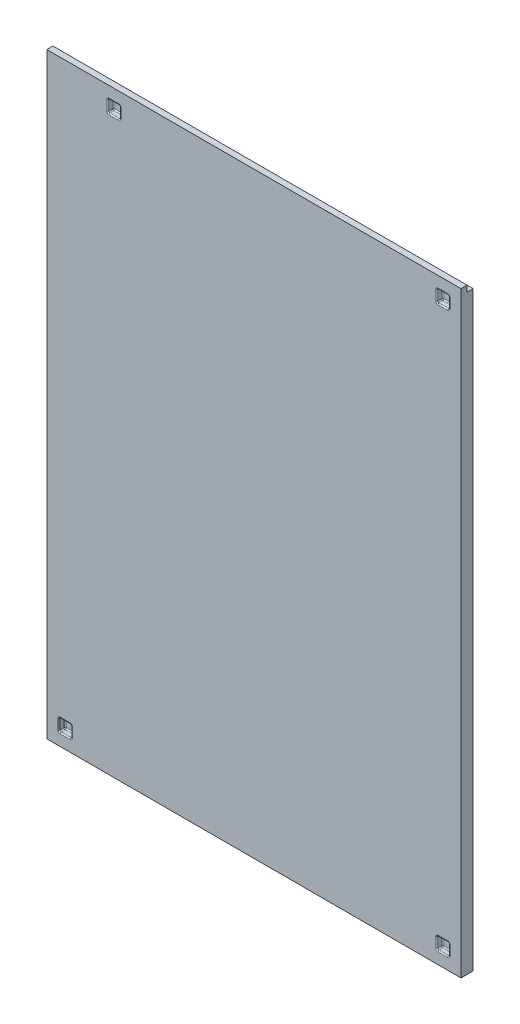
from build123d import *

# Parameters (mm, degrees)
SKIZZE1_W                       = 68
SKIZZE1_H                       = 98
AUFSATZ_LINEAR_AUSTRAGEN1_DEPTH = 2
SKIZZE2_W                       = 2
SKIZZE2_H                       = 2
SCHNITT_LINEAR_AUSTRAGEN1_DEPTH = 1
VERRUNDUNG1_R                   = 0.2
SKIZZE3_W                       = 1
SKIZZE3_H                       = 1
SCHNITT_LINEAR_AUSTRAGEN2_DEPTH = 68


with BuildPart() as part:
    # Skizze1 → Aufsatz-Linear austragen1 (new body)
    with BuildSketch(Plane.XY):
        with Locations((34, 49)):
            Rectangle(SKIZZE1_W, SKIZZE1_H)
    extrude(amount=AUFSATZ_LINEAR_AUSTRAGEN1_DEPTH)

    # Skizze2 → Schnitt-Linear austragen1 (cut)
    with BuildSketch(Plane.XY.offset(2)):
        with Locations((65, 95)):
            Rectangle(SKIZZE2_W, SKIZZE2_H)
        with Locations((11, 95)):
            Rectangle(SKIZZE2_W, SKIZZE2_H)
        with Locations((65, 3)):
            Rectangle(SKIZZE2_W, SKIZZE2_H)
        with Locations((3, 3)):
            Rectangle(SKIZZE2_W, SKIZZE2_H)
    extrude(amount=-SCHNITT_LINEAR_AUSTRAGEN1_DEPTH, mode=Mode.SUBTRACT)

    # Verrundung1
    verrundung1_edges = [part.edges().sort_by_distance(p)[0] for p in [
        (3, 2, 1),
        (4, 2, 1.5),
        (2, 3, 1),
        (2, 2, 1.5),
        (3, 4, 1),
        (2, 4, 1.5),
        (4, 3, 1),
        (4, 4, 1.5),
        (3, 2, 2),
        (4, 3, 2),
        (3, 4, 2),
        (2, 3, 2),
        (64, 3, 1),
        (64, 2, 1.5),
        (65, 4, 1),
        (64, 4, 1.5),
        (66, 3, 1),
        (66, 4, 1.5),
        (65, 2, 1),
        (66, 2, 1.5),
        (64, 3, 2),
        (65, 2, 2),
        (66, 3, 2),
        (65, 4, 2),
        (12, 95, 1),
        (12, 96, 1.5),
        (11, 94, 1),
        (12, 94, 1.5),
        (10, 95, 1),
        (10, 94, 1.5),
        (11, 96, 1),
        (10, 96, 1.5),
        (12, 95, 2),
        (11, 96, 2),
        (10, 95, 2),
        (11, 94, 2),
        (64, 95, 1),
        (64, 94, 1.5),
        (65, 96, 1),
        (64, 96, 1.5),
        (66, 95, 1),
        (66, 96, 1.5),
        (65, 94, 1),
        (66, 94, 1.5),
        (64, 95, 2),
        (65, 94, 2),
        (66, 95, 2),
        (65, 96, 2),
    ]]
    fillet(verrundung1_edges, radius=VERRUNDUNG1_R)

    # Skizze3 → Schnitt-Linear austragen2 (cut)
    with BuildSketch(Plane.ZY):
        with Locations((0.5, 97.5)):
            Rectangle(SKIZZE3_W, SKIZZE3_H)
    extrude(amount=-SCHNITT_LINEAR_AUSTRAGEN2_DEPTH, mode=Mode.SUBTRACT)


solid = part.part
